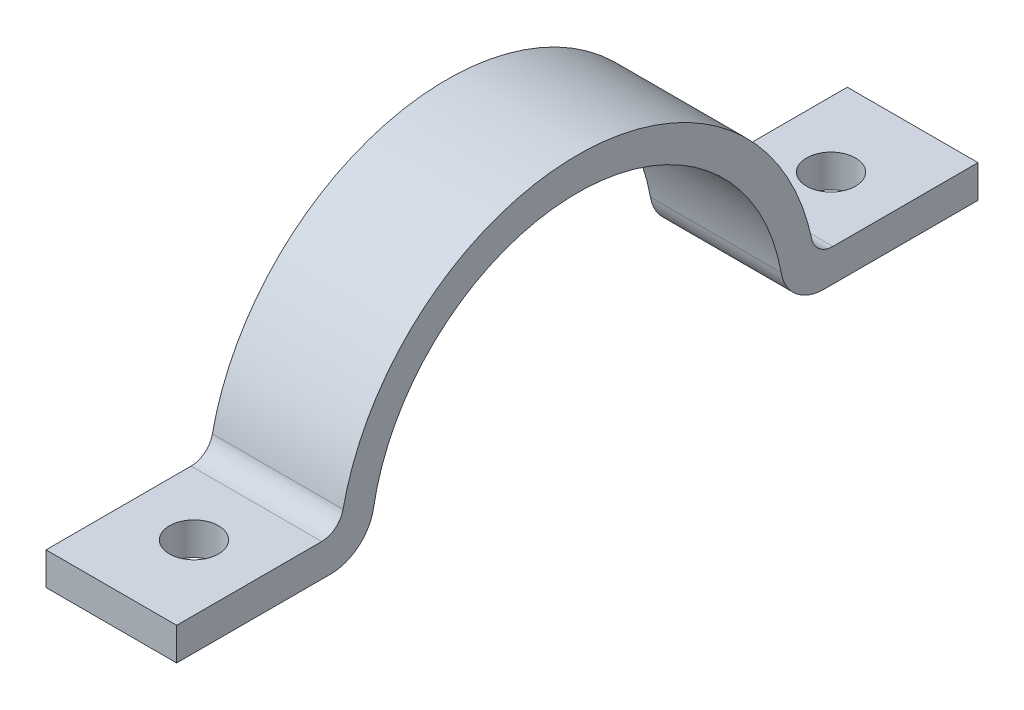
from build123d import *

# Parameters (mm, degrees)
BOSS_EXTRUDE1_DEPTH = 12
SKETCH2_R           = 2.25
CUT_EXTRUDE1_DEPTH  = 44.114206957
LPATTERN1_COUNT     = 2
LPATTERN1_PITCH     = 58.5
FILLET1_R           = 4
FILLET2_R           = 2


with BuildPart() as part:
    # Sketch1 → Boss-Extrude1 (new body)
    with BuildSketch(Plane(origin=(0, 0, 0), x_dir=(0, 0, -1), z_dir=(1, 0, 0))):
        with BuildLine():
            Line((19, 0), (36.794494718, 0))
            Line((36.794494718, 0), (36.794494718, 3))
            Line((36.794494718, 3), (21.794494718, 3))
            ThreePointArc((21.794494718, 3), (0, 22), (-21.794494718, 3))
            Line((-21.794494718, 3), (-36.794494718, 3))
            Line((-36.794494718, 3), (-36.794494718, 0))
            Line((-36.794494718, 0), (-19, 0))
            ThreePointArc((-19, 0), (0, 19), (19, 0))
        make_face()
    extrude(amount=BOSS_EXTRUDE1_DEPTH)

    # Sketch2 → Cut-Extrude1 (cut, through all)
    with BuildSketch(Plane(origin=(0, 3, 0), x_dir=(1, 0, 0), z_dir=(0, 1, 0))):
        with Locations(Location((6, 29.294494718, 0), (0, 0, 270))):
            Circle(SKETCH2_R)
    cut_extrude1 = extrude(amount=-CUT_EXTRUDE1_DEPTH, mode=Mode.SUBTRACT)

    # LPattern1: Cut-Extrude1 ×2
    with Locations(*[(0, 0, i * LPATTERN1_PITCH) for i in range(1, LPATTERN1_COUNT)]):
        add(cut_extrude1, mode=Mode.SUBTRACT)

    # Fillet1
    fillet1_edges = [part.edges().sort_by_distance(p)[0] for p in [
        (6, 0, 19),
        (6, 0, -19),
    ]]
    fillet(fillet1_edges, radius=FILLET1_R)

    # Fillet2
    fillet2_edges = [part.edges().sort_by_distance(p)[0] for p in [
        (6, 3, 21.794494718),
        (6, 3, -21.794494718),
    ]]
    fillet(fillet2_edges, radius=FILLET2_R)


solid = part.part
